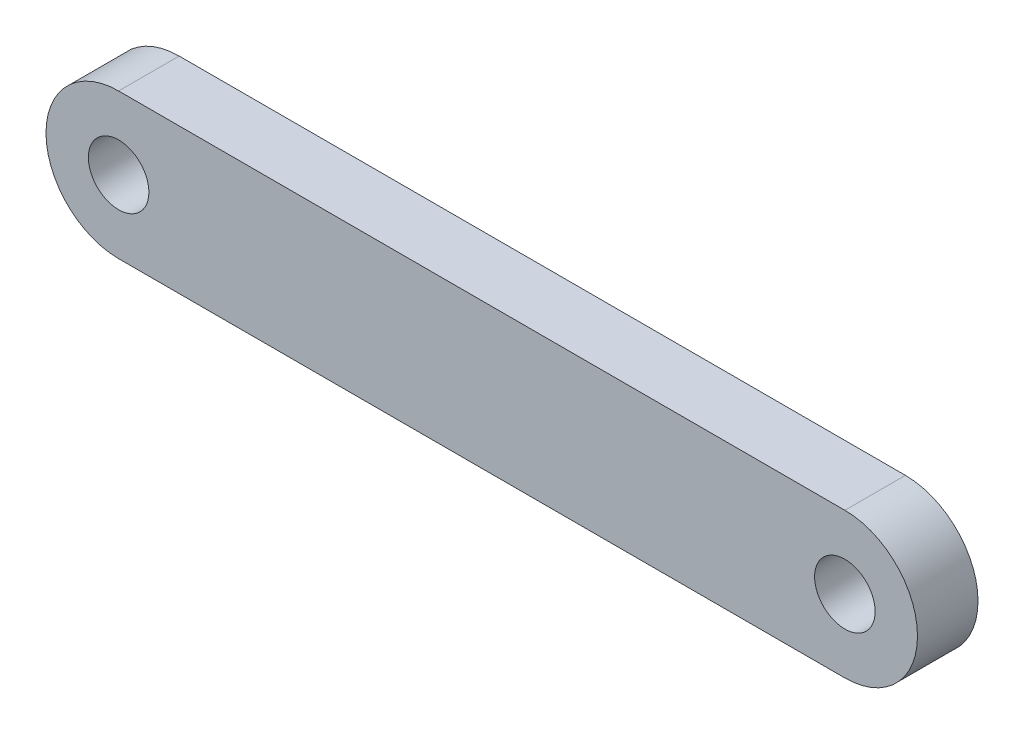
from build123d import *

# Parameters (mm, degrees)
CROQUIS1_R              = 2.5
SALIENTE_EXTRUIR1_DEPTH = 2.5


with BuildPart() as part:
    # Croquis1 → Saliente-Extruir1 (new, symmetric)
    with BuildSketch(Plane.XY):
        with BuildLine():
            Line((-30, 6), (30, 6))
            ThreePointArc((30, 6), (36, 0), (30, -6))
            Line((30, -6), (-30, -6))
            ThreePointArc((-30, -6), (-36, 0), (-30, 6))
        make_face()
        with Locations((30, 0)):
            Circle(CROQUIS1_R, mode=Mode.SUBTRACT)
        with Locations((-30, 0)):
            Circle(CROQUIS1_R, mode=Mode.SUBTRACT)
    extrude(amount=SALIENTE_EXTRUIR1_DEPTH, both=True)


solid = part.part
